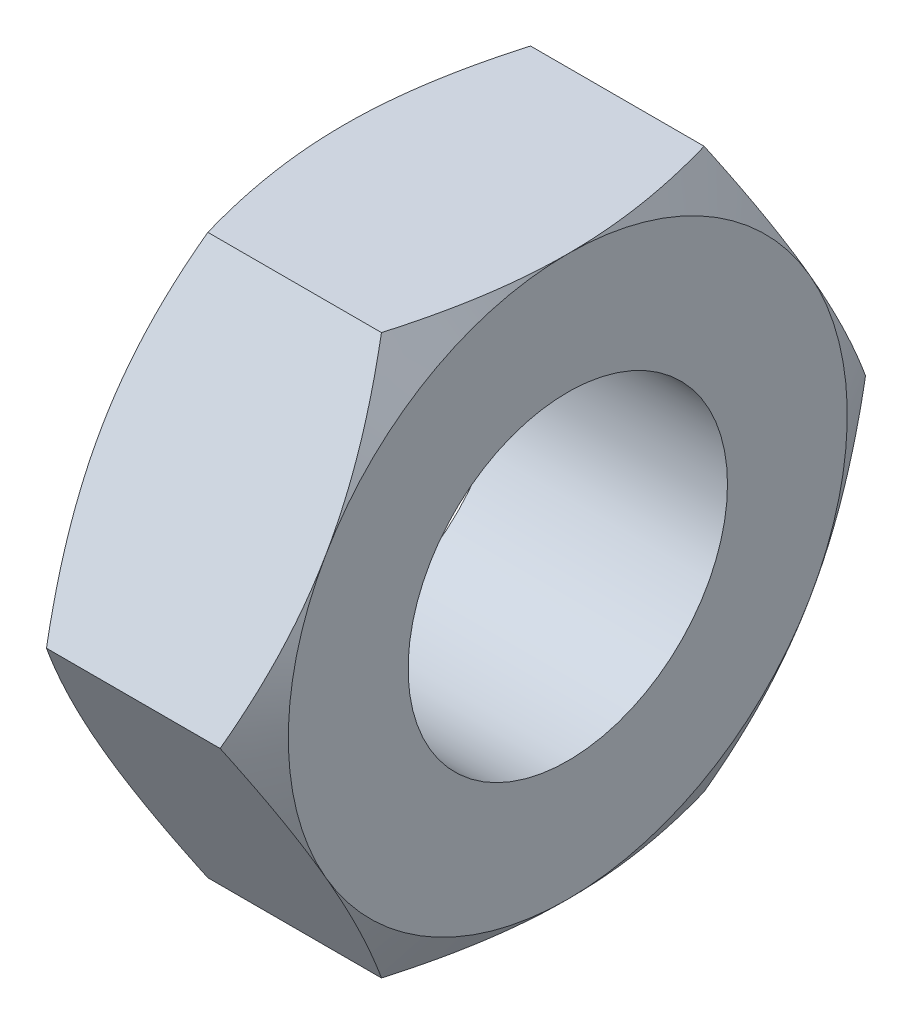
ISO-10303-21;
HEADER;
FILE_DESCRIPTION(('STEP AP214'),'2;1');
FILE_NAME('part.step','',(''),(''),'','','');
FILE_SCHEMA(('AUTOMOTIVE_DESIGN { 1 0 10303 214 1 1 1 1 }'));
ENDSEC;
DATA;
#1=APPLICATION_CONTEXT('core data for automotive mechanical design processes');
#2=APPLICATION_PROTOCOL_DEFINITION('international standard','automotive_design',2000,#1);
#3=PRODUCT_CONTEXT('',#1,'mechanical');
#4=PRODUCT('Part','Part','',(#3));
#5=PRODUCT_RELATED_PRODUCT_CATEGORY('part','',(#4));
#6=PRODUCT_DEFINITION_FORMATION('','',#4);
#7=PRODUCT_DEFINITION_CONTEXT('part definition',#1,'design');
#8=PRODUCT_DEFINITION('design','',#6,#7);
#9=PRODUCT_DEFINITION_SHAPE('','',#8);
#10=(LENGTH_UNIT() NAMED_UNIT(*) SI_UNIT(.MILLI.,.METRE.));
#11=(NAMED_UNIT(*) PLANE_ANGLE_UNIT() SI_UNIT($,.RADIAN.));
#12=(NAMED_UNIT(*) SI_UNIT($,.STERADIAN.) SOLID_ANGLE_UNIT());
#13=UNCERTAINTY_MEASURE_WITH_UNIT(LENGTH_MEASURE(1.E-05),#10,'distance_accuracy_value','');
#14=(GEOMETRIC_REPRESENTATION_CONTEXT(3) GLOBAL_UNCERTAINTY_ASSIGNED_CONTEXT((#13)) GLOBAL_UNIT_ASSIGNED_CONTEXT((#10,
#11,#12)) REPRESENTATION_CONTEXT('',''));
#15=CARTESIAN_POINT('',(0.,0.,0.));
#16=DIRECTION('',(0.,0.,1.));
#17=DIRECTION('',(1.,0.,0.));
#18=AXIS2_PLACEMENT_3D('',#15,#16,#17);
#19=CARTESIAN_POINT('',(0.,0.,0.));
#20=DIRECTION('',(1.,0.,0.));
#21=DIRECTION('',(0.,0.,-1.));
#22=AXIS2_PLACEMENT_3D('',#19,#20,#21);
#23=PLANE('',#22);
#24=CARTESIAN_POINT('',(0.,-0.0499999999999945,0.));
#25=DIRECTION('',(1.,0.,0.));
#26=DIRECTION('',(0.,0.5,-0.866025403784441));
#27=AXIS2_PLACEMENT_3D('',#24,#25,#26);
#28=CIRCLE('',#27,3.49999999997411);
#29=CARTESIAN_POINT('',(0.,1.69999999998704,-3.03108891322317));
#30=VERTEX_POINT('',#29);
#31=CARTESIAN_POINT('',(0.,3.4499999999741,0.));
#32=VERTEX_POINT('',#31);
#33=EDGE_CURVE('E114',#30,#32,#28,.T.);
#34=ORIENTED_EDGE('',*,*,#33,.F.);
#35=CARTESIAN_POINT('',(0.,-0.0499999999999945,0.));
#36=DIRECTION('',(1.,0.,0.));
#37=DIRECTION('',(0.,0.5,-0.866025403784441));
#38=AXIS2_PLACEMENT_3D('',#35,#36,#37);
#39=CIRCLE('',#38,3.49999999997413);
#40=CARTESIAN_POINT('',(0.,-1.79999999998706,-3.03108891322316));
#41=VERTEX_POINT('',#40);
#42=EDGE_CURVE('E103',#41,#30,#39,.T.);
#43=ORIENTED_EDGE('',*,*,#42,.F.);
#44=CARTESIAN_POINT('',(0.,-3.54999999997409,0.));
#45=VERTEX_POINT('',#44);
#46=EDGE_CURVE('E111',#45,#41,#39,.T.);
#47=ORIENTED_EDGE('',*,*,#46,.F.);
#48=CARTESIAN_POINT('',(0.,-1.79999999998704,3.03108891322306));
#49=VERTEX_POINT('',#48);
#50=EDGE_CURVE('E397',#49,#45,#39,.T.);
#51=ORIENTED_EDGE('',*,*,#50,.F.);
#52=CARTESIAN_POINT('',(0.,1.69999999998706,3.03108891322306));
#53=VERTEX_POINT('',#52);
#54=EDGE_CURVE('E395',#53,#49,#39,.T.);
#55=ORIENTED_EDGE('',*,*,#54,.F.);
#56=EDGE_CURVE('E24',#32,#53,#39,.T.);
#57=ORIENTED_EDGE('',*,*,#56,.F.);
#58=EDGE_LOOP('',(#34,#43,#47,#51,#55,#57));
#59=FACE_BOUND('',#58,.T.);
#60=CARTESIAN_POINT('',(0.,-0.0499999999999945,0.));
#61=DIRECTION('',(1.,0.,0.));
#62=DIRECTION('',(0.,0.,-1.));
#63=AXIS2_PLACEMENT_3D('',#60,#61,#62);
#64=CIRCLE('',#63,2.);
#65=CARTESIAN_POINT('',(0.,-0.0499999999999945,-2.00000000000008));
#66=VERTEX_POINT('',#65);
#67=EDGE_CURVE('E11',#66,#66,#64,.F.);
#68=ORIENTED_EDGE('',*,*,#67,.F.);
#69=EDGE_LOOP('',(#68));
#70=FACE_BOUND('',#69,.T.);
#71=ADVANCED_FACE('F17',(#59,#70),#23,.F.);
#72=CARTESIAN_POINT('',(2.48551696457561,-0.0499999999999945,0.));
#73=DIRECTION('',(-1.,0.,0.));
#74=DIRECTION('',(0.,-1.,0.));
#75=AXIS2_PLACEMENT_3D('',#72,#73,#74);
#76=CONICAL_SURFACE('',#75,4.04470059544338,1.04719755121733);
#77=CARTESIAN_POINT('',(2.7999999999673,-3.54999999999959,0.));
#78=CARTESIAN_POINT('',(2.80001430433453,-3.54999999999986,-0.0857684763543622));
#79=CARTESIAN_POINT('',(2.79818014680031,-3.54999999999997,-0.171532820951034));
#80=CARTESIAN_POINT('',(2.79092122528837,-3.55000000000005,-0.342893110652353));
#81=CARTESIAN_POINT('',(2.78549717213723,-3.55000000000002,-0.428489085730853));
#82=CARTESIAN_POINT('',(2.771200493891,-3.55,-0.598959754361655));
#83=CARTESIAN_POINT('',(2.76234522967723,-3.55000000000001,-0.683835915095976));
#84=CARTESIAN_POINT('',(2.74137660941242,-3.55000000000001,-0.853183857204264));
#85=CARTESIAN_POINT('',(2.72926316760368,-3.55000000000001,-0.93765562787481));
#86=CARTESIAN_POINT('',(2.68840979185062,-3.55000000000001,-1.19011421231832));
#87=CARTESIAN_POINT('',(2.65513697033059,-3.55000000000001,-1.35736762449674));
#88=CARTESIAN_POINT('',(2.57840133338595,-3.55000000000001,-1.69043614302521));
#89=CARTESIAN_POINT('',(2.53488762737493,-3.55000000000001,-1.85623963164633));
#90=CARTESIAN_POINT('',(2.4873926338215,-3.55,-2.02072585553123));
#91=B_SPLINE_CURVE_WITH_KNOTS('',3,(#77,#78,#79,#80,#81,#82,#83,#84,#85,#86,#87,#88,#89,#90),
.UNSPECIFIED.,.F.,.F.,(4,2,2,2,2,2,4),(0.,0.257279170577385,0.514507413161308,0.770450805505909,
1.0264009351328,1.53763035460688,2.05145599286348),.UNSPECIFIED.);
#92=CARTESIAN_POINT('',(2.79999999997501,-3.54999999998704,0.));
#93=VERTEX_POINT('',#92);
#94=CARTESIAN_POINT('',(2.4873926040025,-3.5500000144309,-2.02072593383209));
#95=VERTEX_POINT('',#94);
#96=EDGE_CURVE('E350',#93,#95,#91,.T.);
#97=ORIENTED_EDGE('',*,*,#96,.T.);
#98=CARTESIAN_POINT('',(2.48739257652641,-3.5500000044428,-2.02072589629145));
#99=CARTESIAN_POINT('',(2.53488758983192,-3.40755076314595,-2.10296903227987));
#100=CARTESIAN_POINT('',(2.57840130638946,-3.2639607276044,-2.18587078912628));
#101=CARTESIAN_POINT('',(2.65513695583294,-2.9755149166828,-2.35240506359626));
#102=CARTESIAN_POINT('',(2.68840977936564,-2.83066920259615,-2.43603177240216));
#103=CARTESIAN_POINT('',(2.72926315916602,-2.61203364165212,-2.56226107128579));
#104=CARTESIAN_POINT('',(2.74137660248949,-2.53887893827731,-2.60449695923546));
#105=CARTESIAN_POINT('',(2.76234522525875,-2.39221930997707,-2.68917093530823));
#106=CARTESIAN_POINT('',(2.77120049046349,-2.31871439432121,-2.73160901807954));
#107=CARTESIAN_POINT('',(2.78549717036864,-2.17108245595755,-2.81684435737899));
#108=CARTESIAN_POINT('',(2.79092122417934,-2.09695416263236,-2.85964234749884));
#109=CARTESIAN_POINT('',(2.79818014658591,-1.94855178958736,-2.94532249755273));
#110=CARTESIAN_POINT('',(2.80001430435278,-1.87427768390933,-2.98820467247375));
#111=CARTESIAN_POINT('',(2.7999999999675,-1.80000000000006,-3.03108891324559));
#112=B_SPLINE_CURVE_WITH_KNOTS('',3,(#98,#99,#100,#101,#102,#103,#104,#105,#106,#107,#108,#109,
#110,#111),.UNSPECIFIED.,.F.,.F.,(4,2,2,2,2,2,4),(0.,0.513825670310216,1.02505512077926,
1.28100526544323,1.5369486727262,1.79417693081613,2.05145611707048),.UNSPECIFIED.);
#113=CARTESIAN_POINT('',(2.79999999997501,-1.79999999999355,-3.0310889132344));
#114=VERTEX_POINT('',#113);
#115=EDGE_CURVE('E345',#95,#114,#112,.T.);
#116=ORIENTED_EDGE('',*,*,#115,.T.);
#117=CARTESIAN_POINT('',(2.7999999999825,-0.0499999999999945,0.));
#118=DIRECTION('',(-1.,0.,0.));
#119=DIRECTION('',(0.,-1.,0.));
#120=AXIS2_PLACEMENT_3D('',#117,#118,#119);
#121=CIRCLE('',#120,3.49999999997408);
#122=EDGE_CURVE('E309',#93,#114,#121,.F.);
#123=ORIENTED_EDGE('',*,*,#122,.F.);
#124=EDGE_LOOP('',(#97,#116,#123));
#125=FACE_BOUND('',#124,.T.);
#126=ADVANCED_FACE('F242',(#125),#76,.T.);
#127=CARTESIAN_POINT('',(2.48551696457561,-0.0499999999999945,0.));
#128=DIRECTION('',(-1.,0.,0.));
#129=DIRECTION('',(0.,-1.,0.));
#130=AXIS2_PLACEMENT_3D('',#127,#128,#129);
#131=CONICAL_SURFACE('',#130,4.04470059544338,1.04719755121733);
#132=CARTESIAN_POINT('',(2.7999999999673,3.4499999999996,0.));
#133=CARTESIAN_POINT('',(2.80001430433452,3.44999999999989,0.0857684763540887));
#134=CARTESIAN_POINT('',(2.7981801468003,3.45000000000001,0.171532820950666));
#135=CARTESIAN_POINT('',(2.79092122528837,3.4500000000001,0.342893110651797));
#136=CARTESIAN_POINT('',(2.78549717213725,3.45000000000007,0.428489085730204));
#137=CARTESIAN_POINT('',(2.77120049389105,3.45000000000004,0.59895975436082));
#138=CARTESIAN_POINT('',(2.7623452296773,3.45000000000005,0.683835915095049));
#139=CARTESIAN_POINT('',(2.74137660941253,3.45000000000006,0.853183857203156));
#140=CARTESIAN_POINT('',(2.72926316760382,3.45000000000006,0.937655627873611));
#141=CARTESIAN_POINT('',(2.68840979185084,3.45000000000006,1.19011421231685));
#142=CARTESIAN_POINT('',(2.65513697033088,3.45000000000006,1.3573676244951));
#143=CARTESIAN_POINT('',(2.57840133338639,3.45000000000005,1.69043614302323));
#144=CARTESIAN_POINT('',(2.53488762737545,3.45000000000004,1.85623963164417));
#145=CARTESIAN_POINT('',(2.4873926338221,3.45,2.0207258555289));
#146=B_SPLINE_CURVE_WITH_KNOTS('',3,(#132,#133,#134,#135,#136,#137,#138,#139,#140,#141,#142,
#143,#144,#145),.UNSPECIFIED.,.F.,.F.,(4,2,2,2,2,2,4),(0.,0.257279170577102,0.514507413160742,
0.770450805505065,1.02640093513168,1.5376303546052,2.05145599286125),.UNSPECIFIED.);
#147=CARTESIAN_POINT('',(2.79999999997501,3.44999999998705,-1.08962318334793E-13));
#148=VERTEX_POINT('',#147);
#149=CARTESIAN_POINT('',(2.48739260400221,3.45000001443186,2.02072593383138));
#150=VERTEX_POINT('',#149);
#151=EDGE_CURVE('E252',#148,#150,#146,.T.);
#152=ORIENTED_EDGE('',*,*,#151,.T.);
#153=CARTESIAN_POINT('',(2.4873925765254,3.45000000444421,2.02072589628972));
#154=CARTESIAN_POINT('',(2.53488758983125,3.30755076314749,2.10296903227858));
#155=CARTESIAN_POINT('',(2.57840130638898,3.16396072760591,2.18587078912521));
#156=CARTESIAN_POINT('',(2.65513695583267,2.87551491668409,2.35240506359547));
#157=CARTESIAN_POINT('',(2.68840977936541,2.73066920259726,2.43603177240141));
#158=CARTESIAN_POINT('',(2.72926315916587,2.512033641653,2.56226107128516));
#159=CARTESIAN_POINT('',(2.74137660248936,2.43887893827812,2.60449695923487));
#160=CARTESIAN_POINT('',(2.76234522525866,2.29221930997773,2.68917093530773));
#161=CARTESIAN_POINT('',(2.77120049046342,2.2187143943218,2.73160901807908));
#162=CARTESIAN_POINT('',(2.7854971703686,2.07108245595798,2.81684435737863));
#163=CARTESIAN_POINT('',(2.79092122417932,1.99695416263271,2.85964234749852));
#164=CARTESIAN_POINT('',(2.79818014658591,1.84855178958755,2.94532249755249));
#165=CARTESIAN_POINT('',(2.80001430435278,1.77427768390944,2.98820467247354));
#166=CARTESIAN_POINT('',(2.7999999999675,1.70000000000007,3.0310889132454));
#167=B_SPLINE_CURVE_WITH_KNOTS('',3,(#153,#154,#155,#156,#157,#158,#159,#160,#161,#162,#163,
#164,#165,#166),.UNSPECIFIED.,.F.,.F.,(4,2,2,2,2,2,4),(0.,0.513825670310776,1.02505512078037,
1.28100526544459,1.53694867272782,1.79417693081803,2.05145611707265),.UNSPECIFIED.);
#168=CARTESIAN_POINT('',(2.79999999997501,1.69999999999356,3.03108891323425));
#169=VERTEX_POINT('',#168);
#170=EDGE_CURVE('E246',#150,#169,#167,.T.);
#171=ORIENTED_EDGE('',*,*,#170,.T.);
#172=CARTESIAN_POINT('',(2.7999999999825,-0.0499999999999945,0.));
#173=DIRECTION('',(-1.,0.,0.));
#174=DIRECTION('',(0.,-1.,0.));
#175=AXIS2_PLACEMENT_3D('',#172,#173,#174);
#176=CIRCLE('',#175,3.49999999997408);
#177=EDGE_CURVE('E318',#148,#169,#176,.F.);
#178=ORIENTED_EDGE('',*,*,#177,.F.);
#179=EDGE_LOOP('',(#152,#171,#178));
#180=FACE_BOUND('',#179,.T.);
#181=ADVANCED_FACE('F237',(#180),#131,.T.);
#182=CARTESIAN_POINT('',(2.48551696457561,-0.0499999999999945,0.));
#183=DIRECTION('',(-1.,0.,0.));
#184=DIRECTION('',(0.,-1.,0.));
#185=AXIS2_PLACEMENT_3D('',#182,#183,#184);
#186=CONICAL_SURFACE('',#185,4.04470059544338,1.04719755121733);
#187=CARTESIAN_POINT('',(2.7999999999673,-1.79999999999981,-3.0310889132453));
#188=CARTESIAN_POINT('',(2.80001430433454,-1.7257223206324,-3.07397315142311));
#189=CARTESIAN_POINT('',(2.79818014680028,-1.65144821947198,-3.11685532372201));
#190=CARTESIAN_POINT('',(2.79092122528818,-1.50304585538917,-3.20253546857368));
#191=CARTESIAN_POINT('',(2.78549717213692,-1.42891756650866,-3.24533345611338));
#192=CARTESIAN_POINT('',(2.77120049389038,-1.28128563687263,-3.3305687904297));
#193=CARTESIAN_POINT('',(2.76234522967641,-1.20778072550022,-3.37300687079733));
#194=CARTESIAN_POINT('',(2.74137660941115,-1.06112110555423,-3.4576808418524));
#195=CARTESIAN_POINT('',(2.72926316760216,-0.987966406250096,-3.49991672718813));
#196=CARTESIAN_POINT('',(2.68840979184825,-0.769330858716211,-3.62614601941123));
#197=CARTESIAN_POINT('',(2.65513697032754,-0.62448515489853,-3.70977272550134));
#198=CARTESIAN_POINT('',(2.57840133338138,-0.336039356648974,-3.87630698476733));
#199=CARTESIAN_POINT('',(2.53488762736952,-0.192449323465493,-3.95920872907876));
#200=CARTESIAN_POINT('',(2.48739263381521,-0.0500000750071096,-4.04145184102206));
#201=B_SPLINE_CURVE_WITH_KNOTS('',3,(#187,#188,#189,#190,#191,#192,#193,#194,#195,#196,#197,
#198,#199,#200),.UNSPECIFIED.,.F.,.F.,(4,2,2,2,2,2,4),(0.,0.257279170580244,0.514507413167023,
0.770450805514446,1.02640093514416,1.53763035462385,2.05145599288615),.UNSPECIFIED.);
#202=CARTESIAN_POINT('',(2.4873926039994,-0.0500000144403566,-4.04145189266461));
#203=VERTEX_POINT('',#202);
#204=EDGE_CURVE('E331',#114,#203,#201,.T.);
#205=ORIENTED_EDGE('',*,*,#204,.T.);
#206=CARTESIAN_POINT('',(2.4873925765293,-0.0500000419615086,-4.04145186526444));
#207=CARTESIAN_POINT('',(2.53488758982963,0.0924492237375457,-3.9592087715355));
#208=CARTESIAN_POINT('',(2.5784013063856,0.236039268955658,-3.87630703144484));
#209=CARTESIAN_POINT('',(2.65513695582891,0.524485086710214,-3.70977276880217));
#210=CARTESIAN_POINT('',(2.68840977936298,0.669330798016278,-3.62614605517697));
#211=CARTESIAN_POINT('',(2.72926315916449,0.88796635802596,-3.49991675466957));
#212=CARTESIAN_POINT('',(2.74137660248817,0.961121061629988,-3.45768086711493));
#213=CARTESIAN_POINT('',(2.76234522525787,1.10778069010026,-3.37300689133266));
#214=CARTESIAN_POINT('',(2.77120049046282,1.18128560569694,-3.33056880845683));
#215=CARTESIAN_POINT('',(2.78549717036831,1.32891754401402,-3.2453334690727));
#216=CARTESIAN_POINT('',(2.79092122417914,1.40304583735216,-3.20253547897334));
#217=CARTESIAN_POINT('',(2.79818014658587,1.55144821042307,-3.11685532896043));
#218=CARTESIAN_POINT('',(2.80001430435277,1.62572231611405,-3.07397315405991));
#219=CARTESIAN_POINT('',(2.7999999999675,1.69999999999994,-3.03108891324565));
#220=B_SPLINE_CURVE_WITH_KNOTS('',3,(#206,#207,#208,#209,#210,#211,#212,#213,#214,#215,#216,
#217,#218,#219),.UNSPECIFIED.,.F.,.F.,(4,2,2,2,2,2,4),(0.,0.513825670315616,1.02505512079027,
1.28100526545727,1.53694867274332,1.7941769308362,2.05145611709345),.UNSPECIFIED.);
#221=CARTESIAN_POINT('',(2.79999999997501,1.69999999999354,-3.03108891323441));
#222=VERTEX_POINT('',#221);
#223=EDGE_CURVE('E324',#203,#222,#220,.T.);
#224=ORIENTED_EDGE('',*,*,#223,.T.);
#225=CARTESIAN_POINT('',(2.7999999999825,-0.0499999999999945,0.));
#226=DIRECTION('',(-1.,0.,0.));
#227=DIRECTION('',(0.,-1.,0.));
#228=AXIS2_PLACEMENT_3D('',#225,#226,#227);
#229=CIRCLE('',#228,3.49999999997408);
#230=EDGE_CURVE('E112',#114,#222,#229,.F.);
#231=ORIENTED_EDGE('',*,*,#230,.F.);
#232=EDGE_LOOP('',(#205,#224,#231));
#233=FACE_BOUND('',#232,.T.);
#234=ADVANCED_FACE('F241',(#233),#186,.T.);
#235=CARTESIAN_POINT('',(2.48551696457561,-0.0499999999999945,0.));
#236=DIRECTION('',(-1.,0.,0.));
#237=DIRECTION('',(0.,-1.,0.));
#238=AXIS2_PLACEMENT_3D('',#235,#236,#237);
#239=CONICAL_SURFACE('',#238,4.04470059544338,1.04719755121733);
#240=CARTESIAN_POINT('',(2.7999999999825,-0.0499999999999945,0.));
#241=DIRECTION('',(-1.,0.,0.));
#242=DIRECTION('',(0.,-1.,0.));
#243=AXIS2_PLACEMENT_3D('',#240,#241,#242);
#244=CIRCLE('',#243,3.49999999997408);
#245=EDGE_CURVE('E321',#222,#148,#244,.F.);
#246=ORIENTED_EDGE('',*,*,#245,.F.);
#247=CARTESIAN_POINT('',(2.7999999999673,1.69999999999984,-3.03108891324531));
#248=CARTESIAN_POINT('',(2.80001430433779,1.77427768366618,-2.98820467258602));
#249=CARTESIAN_POINT('',(2.79818014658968,1.8485517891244,-2.945322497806));
#250=CARTESIAN_POINT('',(2.79092122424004,1.99695416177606,-2.85964234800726));
#251=CARTESIAN_POINT('',(2.78549717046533,2.07108245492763,-2.8168443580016));
#252=CARTESIAN_POINT('',(2.77120049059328,2.21871439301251,-2.73160901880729));
#253=CARTESIAN_POINT('',(2.76234522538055,2.29221930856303,-2.68917093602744));
#254=CARTESIAN_POINT('',(2.74137660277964,2.43887893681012,-2.60449696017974));
#255=CARTESIAN_POINT('',(2.72926315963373,2.51203364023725,-2.5622610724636));
#256=CARTESIAN_POINT('',(2.68840977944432,2.73066920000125,-2.43603177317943));
#257=CARTESIAN_POINT('',(2.6551369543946,2.87551491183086,-2.35240506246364));
#258=CARTESIAN_POINT('',(2.57840130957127,3.16396072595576,-2.18587079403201));
#259=CARTESIAN_POINT('',(2.53488759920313,3.30755076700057,-2.10296904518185));
#260=CARTESIAN_POINT('',(2.48739260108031,3.45000002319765,-2.0207259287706));
#261=B_SPLINE_CURVE_WITH_KNOTS('',3,(#247,#248,#249,#250,#251,#252,#253,#254,#255,#256,#257,
#258,#259,#260),.UNSPECIFIED.,.F.,.F.,(4,2,2,2,2,2,4),(0.,0.257279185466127,0.514507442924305,
0.770450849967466,1.02640099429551,1.53763044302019,2.05145611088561),.UNSPECIFIED.);
#262=CARTESIAN_POINT('',(2.4873926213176,3.45,-2.02072589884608));
#263=VERTEX_POINT('',#262);
#264=EDGE_CURVE('E259',#222,#263,#261,.T.);
#265=ORIENTED_EDGE('',*,*,#264,.T.);
#266=CARTESIAN_POINT('',(2.4873926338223,3.45,-2.02072585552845));
#267=CARTESIAN_POINT('',(2.53488762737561,3.45000000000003,-1.85623963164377));
#268=CARTESIAN_POINT('',(2.57840133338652,3.45000000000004,-1.69043614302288));
#269=CARTESIAN_POINT('',(2.65513697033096,3.45000000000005,-1.35736762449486));
#270=CARTESIAN_POINT('',(2.68840979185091,3.45000000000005,-1.19011421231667));
#271=CARTESIAN_POINT('',(2.72926316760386,3.45000000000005,-0.93765562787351));
#272=CARTESIAN_POINT('',(2.74137660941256,3.45000000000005,-0.853183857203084));
#273=CARTESIAN_POINT('',(2.76234522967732,3.45000000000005,-0.683835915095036));
#274=CARTESIAN_POINT('',(2.77120049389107,3.45000000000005,-0.598959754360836));
#275=CARTESIAN_POINT('',(2.78549717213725,3.45000000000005,-0.428489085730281));
#276=CARTESIAN_POINT('',(2.79092122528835,3.45000000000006,-0.342893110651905));
#277=CARTESIAN_POINT('',(2.79818014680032,3.45000000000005,-0.17153282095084));
#278=CARTESIAN_POINT('',(2.80001430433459,3.45000000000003,-0.0857684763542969));
#279=CARTESIAN_POINT('',(2.7999999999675,3.45,-1.47017814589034E-13));
#280=B_SPLINE_CURVE_WITH_KNOTS('',3,(#266,#267,#268,#269,#270,#271,#272,#273,#274,#275,#276,
#277,#278,#279),.UNSPECIFIED.,.F.,.F.,(4,2,2,2,2,2,4),(0.,0.513825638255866,1.02505505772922,
1.28100518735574,1.53694857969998,1.79417682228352,2.05145599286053),.UNSPECIFIED.);
#281=EDGE_CURVE('E273',#263,#148,#280,.T.);
#282=ORIENTED_EDGE('',*,*,#281,.T.);
#283=EDGE_LOOP('',(#246,#265,#282));
#284=FACE_BOUND('',#283,.T.);
#285=ADVANCED_FACE('F233',(#284),#239,.T.);
#286=CARTESIAN_POINT('',(2.48551696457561,-0.0499999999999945,0.));
#287=DIRECTION('',(-1.,0.,0.));
#288=DIRECTION('',(0.,-1.,0.));
#289=AXIS2_PLACEMENT_3D('',#286,#287,#288);
#290=CONICAL_SURFACE('',#289,4.04470059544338,1.04719755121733);
#291=CARTESIAN_POINT('',(2.7999999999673,1.69999999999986,3.0310889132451));
#292=CARTESIAN_POINT('',(2.80001430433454,1.6257223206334,3.0739731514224));
#293=CARTESIAN_POINT('',(2.79818014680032,1.55144821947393,3.11685532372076));
#294=CARTESIAN_POINT('',(2.79092122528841,1.40304585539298,3.20253546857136));
#295=CARTESIAN_POINT('',(2.78549717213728,1.32891756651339,3.24533345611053));
#296=CARTESIAN_POINT('',(2.7712004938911,1.1812856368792,3.33056879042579));
#297=CARTESIAN_POINT('',(2.76234522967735,1.10778072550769,3.37300687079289));
#298=CARTESIAN_POINT('',(2.7413766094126,0.961121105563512,3.45768084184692));
#299=CARTESIAN_POINT('',(2.7292631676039,0.88796640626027,3.49991672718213));
#300=CARTESIAN_POINT('',(2.68840979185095,0.669330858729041,3.62614601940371));
#301=CARTESIAN_POINT('',(2.65513697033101,0.5244851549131,3.7097727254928));
#302=CARTESIAN_POINT('',(2.57840133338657,0.236039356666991,3.87630698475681));
#303=CARTESIAN_POINT('',(2.53488762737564,0.0924493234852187,3.95920872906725));
#304=CARTESIAN_POINT('',(2.4873926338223,-0.0499999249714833,4.04145184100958));
#305=B_SPLINE_CURVE_WITH_KNOTS('',3,(#291,#292,#293,#294,#295,#296,#297,#298,#299,#300,#301,
#302,#303,#304),.UNSPECIFIED.,.F.,.F.,(4,2,2,2,2,2,4),(0.,0.25727917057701,0.514507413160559,
0.770450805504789,1.02640093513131,1.53763035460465,2.05145599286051),.UNSPECIFIED.);
#306=CARTESIAN_POINT('',(2.48739260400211,-0.0499999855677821,4.04145189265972));
#307=VERTEX_POINT('',#306);
#308=EDGE_CURVE('E218',#169,#307,#305,.T.);
#309=ORIENTED_EDGE('',*,*,#308,.T.);
#310=CARTESIAN_POINT('',(2.487392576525,-0.0499999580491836,4.04145186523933));
#311=CARTESIAN_POINT('',(2.53488758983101,-0.192449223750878,3.95920877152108));
#312=CARTESIAN_POINT('',(2.57840130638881,-0.336039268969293,3.87630703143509));
#313=CARTESIAN_POINT('',(2.6551369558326,-0.624485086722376,3.70977276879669));
#314=CARTESIAN_POINT('',(2.68840977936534,-0.769330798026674,3.62614605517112));
#315=CARTESIAN_POINT('',(2.72926315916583,-0.987966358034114,3.49991675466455));
#316=CARTESIAN_POINT('',(2.74137660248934,-1.06112106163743,3.45768086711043));
#317=CARTESIAN_POINT('',(2.76234522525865,-1.20778069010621,3.3730068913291));
#318=CARTESIAN_POINT('',(2.77120049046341,-1.2812856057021,3.33056880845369));
#319=CARTESIAN_POINT('',(2.7854971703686,-1.42891754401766,3.24533346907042));
#320=CARTESIAN_POINT('',(2.79092122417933,-1.50304583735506,3.20253547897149));
#321=CARTESIAN_POINT('',(2.79818014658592,-1.65144821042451,3.11685532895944));
#322=CARTESIAN_POINT('',(2.80001430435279,-1.72572231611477,3.07397315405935));
#323=CARTESIAN_POINT('',(2.7999999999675,-1.79999999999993,3.0310889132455));
#324=B_SPLINE_CURVE_WITH_KNOTS('',3,(#310,#311,#312,#313,#314,#315,#316,#317,#318,#319,#320,
#321,#322,#323),.UNSPECIFIED.,.F.,.F.,(4,2,2,2,2,2,4),(0.,0.513825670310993,1.02505512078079,
1.28100526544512,1.53694867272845,1.79417693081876,2.05145611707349),.UNSPECIFIED.);
#325=CARTESIAN_POINT('',(2.79999999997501,-1.79999999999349,3.03108891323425));
#326=VERTEX_POINT('',#325);
#327=EDGE_CURVE('E209',#307,#326,#324,.T.);
#328=ORIENTED_EDGE('',*,*,#327,.T.);
#329=CARTESIAN_POINT('',(2.7999999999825,-0.0499999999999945,0.));
#330=DIRECTION('',(-1.,0.,0.));
#331=DIRECTION('',(0.,-1.,0.));
#332=AXIS2_PLACEMENT_3D('',#329,#330,#331);
#333=CIRCLE('',#332,3.49999999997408);
#334=EDGE_CURVE('E315',#169,#326,#333,.F.);
#335=ORIENTED_EDGE('',*,*,#334,.F.);
#336=EDGE_LOOP('',(#309,#328,#335));
#337=FACE_BOUND('',#336,.T.);
#338=ADVANCED_FACE('F228',(#337),#290,.T.);
#339=CARTESIAN_POINT('',(2.48551696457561,-0.0499999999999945,0.));
#340=DIRECTION('',(-1.,0.,0.));
#341=DIRECTION('',(0.,-1.,0.));
#342=AXIS2_PLACEMENT_3D('',#339,#340,#341);
#343=CONICAL_SURFACE('',#342,4.04470059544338,1.04719755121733);
#344=CARTESIAN_POINT('',(2.7999999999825,-0.0499999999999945,0.));
#345=DIRECTION('',(-1.,0.,0.));
#346=DIRECTION('',(0.,-1.,0.));
#347=AXIS2_PLACEMENT_3D('',#344,#345,#346);
#348=CIRCLE('',#347,3.49999999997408);
#349=EDGE_CURVE('E312',#326,#93,#348,.F.);
#350=ORIENTED_EDGE('',*,*,#349,.F.);
#351=CARTESIAN_POINT('',(2.7999999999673,-1.79999999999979,3.03108891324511));
#352=CARTESIAN_POINT('',(2.8000143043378,-1.87427768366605,2.9882046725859));
#353=CARTESIAN_POINT('',(2.79818014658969,-1.94855178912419,2.94532249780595));
#354=CARTESIAN_POINT('',(2.79092122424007,-2.09695416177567,2.85964234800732));
#355=CARTESIAN_POINT('',(2.78549717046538,-2.17108245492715,2.81684435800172));
#356=CARTESIAN_POINT('',(2.77120049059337,-2.31871439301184,2.73160901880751));
#357=CARTESIAN_POINT('',(2.76234522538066,-2.39221930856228,2.68917093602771));
#358=CARTESIAN_POINT('',(2.74137660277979,-2.5388789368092,2.60449696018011));
#359=CARTESIAN_POINT('',(2.72926315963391,-2.61203364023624,2.56226107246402));
#360=CARTESIAN_POINT('',(2.6884097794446,-2.83066919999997,2.43603177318));
#361=CARTESIAN_POINT('',(2.65513695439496,-2.97551491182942,2.3524050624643));
#362=CARTESIAN_POINT('',(2.57840130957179,-3.26396072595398,2.18587079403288));
#363=CARTESIAN_POINT('',(2.53488759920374,-3.40755076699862,2.10296904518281));
#364=CARTESIAN_POINT('',(2.48739260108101,-3.55000002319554,2.02072592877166));
#365=B_SPLINE_CURVE_WITH_KNOTS('',3,(#351,#352,#353,#354,#355,#356,#357,#358,#359,#360,#361,
#362,#363,#364),.UNSPECIFIED.,.F.,.F.,(4,2,2,2,2,2,4),(0.,0.257279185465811,0.514507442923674,
0.770450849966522,1.02640099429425,1.53763044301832,2.0514561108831),.UNSPECIFIED.);
#366=CARTESIAN_POINT('',(2.48739262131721,-3.55,2.02072589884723));
#367=VERTEX_POINT('',#366);
#368=EDGE_CURVE('E200',#326,#367,#365,.T.);
#369=ORIENTED_EDGE('',*,*,#368,.T.);
#370=CARTESIAN_POINT('',(2.4873926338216,-3.55,2.02072585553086));
#371=CARTESIAN_POINT('',(2.534887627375,-3.55,1.85623963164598));
#372=CARTESIAN_POINT('',(2.57840133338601,-3.55,1.69043614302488));
#373=CARTESIAN_POINT('',(2.65513697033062,-3.55,1.35736762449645));
#374=CARTESIAN_POINT('',(2.68840979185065,-3.55,1.19011421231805));
#375=CARTESIAN_POINT('',(2.7292631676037,-3.55,0.937655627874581));
#376=CARTESIAN_POINT('',(2.74137660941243,-3.55,0.853183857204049));
#377=CARTESIAN_POINT('',(2.76234522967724,-3.55,0.683835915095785));
#378=CARTESIAN_POINT('',(2.77120049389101,-3.55,0.598959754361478));
#379=CARTESIAN_POINT('',(2.78549717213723,-3.55000000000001,0.428489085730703));
#380=CARTESIAN_POINT('',(2.79092122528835,-3.55000000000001,0.342893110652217));
#381=CARTESIAN_POINT('',(2.79818014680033,-3.55000000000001,0.17153282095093));
#382=CARTESIAN_POINT('',(2.80001430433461,-3.55,0.0857684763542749));
#383=CARTESIAN_POINT('',(2.7999999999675,-3.55,0.));
#384=B_SPLINE_CURVE_WITH_KNOTS('',3,(#370,#371,#372,#373,#374,#375,#376,#377,#378,#379,#380,
#381,#382,#383),.UNSPECIFIED.,.F.,.F.,(4,2,2,2,2,2,4),(0.,0.513825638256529,1.02505505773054,
1.28100518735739,1.53694857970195,1.79417682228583,2.05145599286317),.UNSPECIFIED.);
#385=EDGE_CURVE('E217',#367,#93,#384,.T.);
#386=ORIENTED_EDGE('',*,*,#385,.T.);
#387=EDGE_LOOP('',(#350,#369,#386));
#388=FACE_BOUND('',#387,.T.);
#389=ADVANCED_FACE('F232',(#388),#343,.T.);
#390=CARTESIAN_POINT('',(-0.4,3.45000000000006,2.02072594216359));
#391=DIRECTION('',(0.,0.5,0.866025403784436));
#392=DIRECTION('',(0.,-0.866025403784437,0.5));
#393=AXIS2_PLACEMENT_3D('',#390,#391,#392);
#394=PLANE('',#393);
#395=DIRECTION('',(1.,0.,0.));
#396=VECTOR('',#395,1.);
#397=CARTESIAN_POINT('',(-0.4,3.45000000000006,2.02072594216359));
#398=LINE('',#397,#396);
#399=CARTESIAN_POINT('',(0.312607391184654,3.45000000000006,2.02072594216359));
#400=VERTEX_POINT('',#399);
#401=EDGE_CURVE('E299',#150,#400,#398,.F.);
#402=ORIENTED_EDGE('',*,*,#401,.T.);
#403=CARTESIAN_POINT('',(0.312708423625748,3.45030307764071,2.02055096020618));
#404=CARTESIAN_POINT('',(0.261417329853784,3.29649415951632,2.10935258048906));
#405=CARTESIAN_POINT('',(0.214769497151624,3.14135757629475,2.1989207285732));
#406=CARTESIAN_POINT('',(0.133344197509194,2.82839790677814,2.3796080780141));
#407=CARTESIAN_POINT('',(0.09859553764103,2.67056925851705,2.47073049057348));
#408=CARTESIAN_POINT('',(0.0445027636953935,2.35686800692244,2.65184599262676));
#409=CARTESIAN_POINT('',(0.0247986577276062,2.20104367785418,2.74181121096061));
#410=CARTESIAN_POINT('',(0.0012735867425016,1.88866159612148,2.92216508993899));
#411=CARTESIAN_POINT('',(-0.00256685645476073,1.7321049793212,3.01255309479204));
#412=CARTESIAN_POINT('',(0.00541113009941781,1.4395557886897,3.18145644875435));
#413=CARTESIAN_POINT('',(0.0152706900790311,1.30351948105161,3.25999704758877));
#414=CARTESIAN_POINT('',(0.0465232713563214,1.03233316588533,3.41656653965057));
#415=CARTESIAN_POINT('',(0.0679269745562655,0.8971840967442,3.49459489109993));
#416=CARTESIAN_POINT('',(0.121435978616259,0.625438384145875,3.6514873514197));
#417=CARTESIAN_POINT('',(0.153768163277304,0.488876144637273,3.73033159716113));
#418=CARTESIAN_POINT('',(0.227150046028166,0.217788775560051,3.88684396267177));
#419=CARTESIAN_POINT('',(0.268182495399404,0.0832601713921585,3.96451408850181));
#420=CARTESIAN_POINT('',(0.312708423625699,-0.0503030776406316,4.04162686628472));
#421=B_SPLINE_CURVE_WITH_KNOTS('',3,(#403,#404,#405,#406,#407,#408,#409,#410,#411,#412,#413,
#414,#415,#416,#417,#418,#419,#420),.UNSPECIFIED.,.F.,.F.,(4,2,2,2,2,2,2,2,4),(0.,
0.554801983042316,1.11093776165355,1.65330856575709,2.19501322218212,2.66673515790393,
3.13889433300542,3.62152851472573,4.10321464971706),.UNSPECIFIED.);
#422=EDGE_CURVE('E381',#400,#53,#421,.T.);
#423=ORIENTED_EDGE('',*,*,#422,.T.);
#424=CARTESIAN_POINT('',(0.312607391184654,-0.0499999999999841,4.04145188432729));
#425=VERTEX_POINT('',#424);
#426=EDGE_CURVE('E182',#53,#425,#421,.T.);
#427=ORIENTED_EDGE('',*,*,#426,.T.);
#428=DIRECTION('',(1.,0.,0.));
#429=VECTOR('',#428,1.);
#430=CARTESIAN_POINT('',(-0.4,-0.0499999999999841,4.04145188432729));
#431=LINE('',#430,#429);
#432=EDGE_CURVE('E294',#307,#425,#431,.F.);
#433=ORIENTED_EDGE('',*,*,#432,.F.);
#434=ORIENTED_EDGE('',*,*,#308,.F.);
#435=ORIENTED_EDGE('',*,*,#170,.F.);
#436=EDGE_LOOP('',(#402,#423,#427,#433,#434,#435));
#437=FACE_BOUND('',#436,.T.);
#438=ADVANCED_FACE('F193',(#437),#394,.T.);
#439=CARTESIAN_POINT('',(-0.4,-0.0499999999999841,4.04145188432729));
#440=DIRECTION('',(0.,-0.5,0.86602540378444));
#441=DIRECTION('',(0.,-0.866025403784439,-0.5));
#442=AXIS2_PLACEMENT_3D('',#439,#440,#441);
#443=PLANE('',#442);
#444=ORIENTED_EDGE('',*,*,#432,.T.);
#445=CARTESIAN_POINT('',(0.312694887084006,-0.0497375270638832,4.04160342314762));
#446=CARTESIAN_POINT('',(0.261404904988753,-0.203545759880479,3.95280219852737));
#447=CARTESIAN_POINT('',(0.214758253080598,-0.358681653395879,3.86323444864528));
#448=CARTESIAN_POINT('',(0.133335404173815,-0.671639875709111,3.68254793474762));
#449=CARTESIAN_POINT('',(0.0985880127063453,-0.829467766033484,3.59142595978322));
#450=CARTESIAN_POINT('',(0.0444977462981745,-1.1431675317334,3.41031131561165));
#451=CARTESIAN_POINT('',(0.0247948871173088,-1.2989911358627,3.32034651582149));
#452=CARTESIAN_POINT('',(0.00127222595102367,-1.61137168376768,3.13999352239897));
#453=CARTESIAN_POINT('',(-0.00256705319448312,-1.76792749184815,3.04960598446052));
#454=CARTESIAN_POINT('',(0.00541277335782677,-2.06046981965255,2.88070659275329));
#455=CARTESIAN_POINT('',(0.0152725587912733,-2.19650009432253,2.80216947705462));
#456=CARTESIAN_POINT('',(0.0465245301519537,-2.46767439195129,2.64560692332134));
#457=CARTESIAN_POINT('',(0.0679273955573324,-2.60281747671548,2.56758202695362));
#458=CARTESIAN_POINT('',(0.121433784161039,-2.87455104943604,2.41069657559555));
#459=CARTESIAN_POINT('',(0.153764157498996,-3.01110713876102,2.33185588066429));
#460=CARTESIAN_POINT('',(0.227141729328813,-3.28218241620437,2.17535049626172));
#461=CARTESIAN_POINT('',(0.268171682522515,-3.41670507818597,2.09768380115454));
#462=CARTESIAN_POINT('',(0.312694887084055,-3.55026247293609,2.02057440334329));
#463=B_SPLINE_CURVE_WITH_KNOTS('',3,(#445,#446,#447,#448,#449,#450,#451,#452,#453,#454,#455,
#456,#457,#458,#459,#460,#461,#462),.UNSPECIFIED.,.F.,.F.,(4,2,2,2,2,2,2,2,4),(0.,
0.554798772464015,1.11093125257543,1.65329915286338,2.1950009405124,2.66670212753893,
3.13884047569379,3.62145272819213,4.10311708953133),.UNSPECIFIED.);
#464=EDGE_CURVE('E180',#425,#49,#463,.T.);
#465=ORIENTED_EDGE('',*,*,#464,.T.);
#466=CARTESIAN_POINT('',(0.312607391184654,-3.55,2.02072594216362));
#467=VERTEX_POINT('',#466);
#468=EDGE_CURVE('E173',#49,#467,#463,.T.);
#469=ORIENTED_EDGE('',*,*,#468,.T.);
#470=DIRECTION('',(1.,0.,0.));
#471=VECTOR('',#470,1.);
#472=CARTESIAN_POINT('',(-0.4,-3.55,2.02072594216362));
#473=LINE('',#472,#471);
#474=EDGE_CURVE('E289',#367,#467,#473,.F.);
#475=ORIENTED_EDGE('',*,*,#474,.F.);
#476=ORIENTED_EDGE('',*,*,#368,.F.);
#477=ORIENTED_EDGE('',*,*,#327,.F.);
#478=EDGE_LOOP('',(#444,#465,#469,#475,#476,#477));
#479=FACE_BOUND('',#478,.T.);
#480=ADVANCED_FACE('F189',(#479),#443,.T.);
#481=CARTESIAN_POINT('',(-0.4,-3.55,2.02072594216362));
#482=DIRECTION('',(0.,-1.,0.));
#483=DIRECTION('',(1.,0.,0.));
#484=AXIS2_PLACEMENT_3D('',#481,#482,#483);
#485=PLANE('',#484);
#486=ORIENTED_EDGE('',*,*,#474,.T.);
#487=CARTESIAN_POINT('',(0.312708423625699,-3.55,2.02107590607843));
#488=CARTESIAN_POINT('',(0.261417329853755,-3.55,1.84347266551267));
#489=CARTESIAN_POINT('',(0.214769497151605,-3.55,1.6643363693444));
#490=CARTESIAN_POINT('',(0.133344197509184,-3.55,1.30296167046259));
#491=CARTESIAN_POINT('',(0.0985955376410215,-3.55,1.12071684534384));
#492=CARTESIAN_POINT('',(0.0445027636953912,-3.55,0.758485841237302));
#493=CARTESIAN_POINT('',(0.0247986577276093,-3.55000000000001,0.578555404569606));
#494=CARTESIAN_POINT('',(0.00127358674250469,-3.55,0.217847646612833));
#495=CARTESIAN_POINT('',(-0.00256685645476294,-3.55,0.037071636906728));
#496=CARTESIAN_POINT('',(0.00541113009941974,-3.55,-0.300735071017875));
#497=CARTESIAN_POINT('',(0.0152706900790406,-3.55000000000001,-0.457816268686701));
#498=CARTESIAN_POINT('',(0.0465232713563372,-3.55000000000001,-0.770955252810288));
#499=CARTESIAN_POINT('',(0.06792697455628,-3.55000000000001,-0.927011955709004));
#500=CARTESIAN_POINT('',(0.121435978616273,-3.55000000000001,-1.24079687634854));
#501=CARTESIAN_POINT('',(0.153768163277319,-3.55000000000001,-1.39848536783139));
#502=CARTESIAN_POINT('',(0.227150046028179,-3.55000000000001,-1.71151009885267));
#503=CARTESIAN_POINT('',(0.268182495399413,-3.55000000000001,-1.86685035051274));
#504=CARTESIAN_POINT('',(0.312708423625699,-3.55,-2.02107590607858));
#505=B_SPLINE_CURVE_WITH_KNOTS('',3,(#487,#488,#489,#490,#491,#492,#493,#494,#495,#496,#497,
#498,#499,#500,#501,#502,#503,#504),.UNSPECIFIED.,.F.,.F.,(4,2,2,2,2,2,2,2,4),(0.,
0.554801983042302,1.11093776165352,1.65330856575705,2.19501322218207,2.66673515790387,
3.13889433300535,3.62152851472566,4.10321464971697),.UNSPECIFIED.);
#506=EDGE_CURVE('E181',#467,#45,#505,.T.);
#507=ORIENTED_EDGE('',*,*,#506,.T.);
#508=CARTESIAN_POINT('',(0.312607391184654,-3.55,-2.02072594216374));
#509=VERTEX_POINT('',#508);
#510=EDGE_CURVE('E166',#45,#509,#505,.T.);
#511=ORIENTED_EDGE('',*,*,#510,.T.);
#512=DIRECTION('',(1.,0.,0.));
#513=VECTOR('',#512,1.);
#514=CARTESIAN_POINT('',(-0.4,-3.55,-2.02072594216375));
#515=LINE('',#514,#513);
#516=EDGE_CURVE('E281',#95,#509,#515,.F.);
#517=ORIENTED_EDGE('',*,*,#516,.F.);
#518=ORIENTED_EDGE('',*,*,#96,.F.);
#519=ORIENTED_EDGE('',*,*,#385,.F.);
#520=EDGE_LOOP('',(#486,#507,#511,#517,#518,#519));
#521=FACE_BOUND('',#520,.T.);
#522=ADVANCED_FACE('F192',(#521),#485,.T.);
#523=CARTESIAN_POINT('',(-0.4,-3.55,-2.02072594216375));
#524=DIRECTION('',(0.,-0.5,-0.866025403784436));
#525=DIRECTION('',(0.,0.866025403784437,-0.5));
#526=AXIS2_PLACEMENT_3D('',#523,#524,#525);
#527=PLANE('',#526);
#528=ORIENTED_EDGE('',*,*,#516,.T.);
#529=CARTESIAN_POINT('',(0.312708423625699,-3.55030307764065,-2.02055096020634));
#530=CARTESIAN_POINT('',(0.261417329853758,-3.39649415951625,-2.10935258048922));
#531=CARTESIAN_POINT('',(0.214769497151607,-3.24135757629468,-2.19892072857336));
#532=CARTESIAN_POINT('',(0.133344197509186,-2.92839790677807,-2.37960807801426));
#533=CARTESIAN_POINT('',(0.0985955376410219,-2.77056925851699,-2.47073049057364));
#534=CARTESIAN_POINT('',(0.0445027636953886,-2.45686800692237,-2.65184599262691));
#535=CARTESIAN_POINT('',(0.024798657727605,-2.30104367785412,-2.74181121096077));
#536=CARTESIAN_POINT('',(0.00127358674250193,-1.98866159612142,-2.92216508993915));
#537=CARTESIAN_POINT('',(-0.00256685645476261,-1.83210497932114,-3.01255309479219));
#538=CARTESIAN_POINT('',(0.0054111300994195,-1.53955578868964,-3.1814564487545));
#539=CARTESIAN_POINT('',(0.0152706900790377,-1.40351948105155,-3.25999704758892));
#540=CARTESIAN_POINT('',(0.0465232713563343,-1.13233316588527,-3.41656653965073));
#541=CARTESIAN_POINT('',(0.0679269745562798,-0.997184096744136,-3.49459489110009));
#542=CARTESIAN_POINT('',(0.121435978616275,-0.725438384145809,-3.65148735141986));
#543=CARTESIAN_POINT('',(0.153768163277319,-0.588876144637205,-3.73033159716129));
#544=CARTESIAN_POINT('',(0.227150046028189,-0.317788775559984,-3.88684396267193));
#545=CARTESIAN_POINT('',(0.268182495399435,-0.183260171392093,-3.96451408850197));
#546=CARTESIAN_POINT('',(0.312708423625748,-0.0496969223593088,-4.04162686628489));
#547=B_SPLINE_CURVE_WITH_KNOTS('',3,(#529,#530,#531,#532,#533,#534,#535,#536,#537,#538,#539,
#540,#541,#542,#543,#544,#545,#546),.UNSPECIFIED.,.F.,.F.,(4,2,2,2,2,2,2,2,4),(0.,
0.554801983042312,1.11093776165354,1.65330856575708,2.19501322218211,2.66673515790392,
3.13889433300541,3.62152851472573,4.10321464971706),.UNSPECIFIED.);
#548=EDGE_CURVE('E377',#509,#41,#547,.T.);
#549=ORIENTED_EDGE('',*,*,#548,.T.);
#550=CARTESIAN_POINT('',(0.312607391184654,-0.0500000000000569,-4.04145188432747));
#551=VERTEX_POINT('',#550);
#552=EDGE_CURVE('E108',#41,#551,#547,.T.);
#553=ORIENTED_EDGE('',*,*,#552,.T.);
#554=DIRECTION('',(1.,0.,0.));
#555=VECTOR('',#554,1.);
#556=CARTESIAN_POINT('',(-0.4,-0.0500000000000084,-4.04145188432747));
#557=LINE('',#556,#555);
#558=EDGE_CURVE('E130',#203,#551,#557,.F.);
#559=ORIENTED_EDGE('',*,*,#558,.F.);
#560=ORIENTED_EDGE('',*,*,#204,.F.);
#561=ORIENTED_EDGE('',*,*,#115,.F.);
#562=EDGE_LOOP('',(#528,#549,#553,#559,#560,#561));
#563=FACE_BOUND('',#562,.T.);
#564=ADVANCED_FACE('F387',(#563),#527,.T.);
#565=CARTESIAN_POINT('',(-0.4,-0.0500000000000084,-4.04145188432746));
#566=DIRECTION('',(0.,0.5,-0.86602540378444));
#567=DIRECTION('',(0.,0.866025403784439,0.5));
#568=AXIS2_PLACEMENT_3D('',#565,#566,#567);
#569=PLANE('',#568);
#570=ORIENTED_EDGE('',*,*,#558,.T.);
#571=CARTESIAN_POINT('',(0.312694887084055,-0.0502624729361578,-4.04160342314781));
#572=CARTESIAN_POINT('',(0.261404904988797,0.103545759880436,-3.95280219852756));
#573=CARTESIAN_POINT('',(0.214758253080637,0.258681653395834,-3.86323444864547));
#574=CARTESIAN_POINT('',(0.133335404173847,0.571639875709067,-3.68254793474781));
#575=CARTESIAN_POINT('',(0.0985880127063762,0.72946776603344,-3.59142595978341));
#576=CARTESIAN_POINT('',(0.0444977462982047,1.04316753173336,-3.41031131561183));
#577=CARTESIAN_POINT('',(0.0247948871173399,1.19899113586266,-3.32034651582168));
#578=CARTESIAN_POINT('',(0.00127222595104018,1.51137168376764,-3.13999352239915));
#579=CARTESIAN_POINT('',(-0.00256705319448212,1.66792749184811,-3.04960598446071));
#580=CARTESIAN_POINT('',(0.00541277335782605,1.96046981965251,-2.88070659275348));
#581=CARTESIAN_POINT('',(0.0152725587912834,2.0965000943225,-2.8021694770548));
#582=CARTESIAN_POINT('',(0.0465245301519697,2.36767439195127,-2.64560692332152));
#583=CARTESIAN_POINT('',(0.0679273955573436,2.50281747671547,-2.56758202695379));
#584=CARTESIAN_POINT('',(0.121433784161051,2.77455104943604,-2.41069657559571));
#585=CARTESIAN_POINT('',(0.153764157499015,2.91110713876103,-2.33185588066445));
#586=CARTESIAN_POINT('',(0.227141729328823,3.18218241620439,-2.17535049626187));
#587=CARTESIAN_POINT('',(0.268171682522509,3.31670507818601,-2.09768380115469));
#588=CARTESIAN_POINT('',(0.312694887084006,3.45026247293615,-2.02057440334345));
#589=B_SPLINE_CURVE_WITH_KNOTS('',3,(#571,#572,#573,#574,#575,#576,#577,#578,#579,#580,#581,
#582,#583,#584,#585,#586,#587,#588),.UNSPECIFIED.,.F.,.F.,(4,2,2,2,2,2,2,2,4),(0.,
0.554798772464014,1.11093125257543,1.65329915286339,2.19500094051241,2.66670212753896,
3.13884047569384,3.6214527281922,4.10311708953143),.UNSPECIFIED.);
#590=EDGE_CURVE('E106',#551,#30,#589,.T.);
#591=ORIENTED_EDGE('',*,*,#590,.T.);
#592=CARTESIAN_POINT('',(0.312607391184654,3.45000000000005,-2.02072594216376));
#593=VERTEX_POINT('',#592);
#594=EDGE_CURVE('E118',#30,#593,#589,.T.);
#595=ORIENTED_EDGE('',*,*,#594,.T.);
#596=DIRECTION('',(1.,0.,0.));
#597=VECTOR('',#596,1.);
#598=CARTESIAN_POINT('',(-0.4,3.45000000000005,-2.02072594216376));
#599=LINE('',#598,#597);
#600=EDGE_CURVE('E279',#593,#263,#599,.T.);
#601=ORIENTED_EDGE('',*,*,#600,.T.);
#602=ORIENTED_EDGE('',*,*,#264,.F.);
#603=ORIENTED_EDGE('',*,*,#223,.F.);
#604=EDGE_LOOP('',(#570,#591,#595,#601,#602,#603));
#605=FACE_BOUND('',#604,.T.);
#606=ADVANCED_FACE('F128',(#605),#569,.T.);
#607=CARTESIAN_POINT('',(0.554504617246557,-0.0499999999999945,0.));
#608=DIRECTION('',(1.,0.,0.));
#609=DIRECTION('',(0.,0.5,-0.866025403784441));
#610=AXIS2_PLACEMENT_3D('',#607,#608,#609);
#611=CONICAL_SURFACE('',#610,4.46043017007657,1.0471975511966);
#612=ORIENTED_EDGE('',*,*,#42,.T.);
#613=ORIENTED_EDGE('',*,*,#590,.F.);
#614=ORIENTED_EDGE('',*,*,#552,.F.);
#615=EDGE_LOOP('',(#612,#613,#614));
#616=FACE_BOUND('',#615,.T.);
#617=ADVANCED_FACE('F104',(#616),#611,.T.);
#618=ORIENTED_EDGE('',*,*,#46,.T.);
#619=ORIENTED_EDGE('',*,*,#548,.F.);
#620=ORIENTED_EDGE('',*,*,#510,.F.);
#621=EDGE_LOOP('',(#618,#619,#620));
#622=FACE_BOUND('',#621,.T.);
#623=ADVANCED_FACE('F151',(#622),#611,.T.);
#624=ORIENTED_EDGE('',*,*,#50,.T.);
#625=ORIENTED_EDGE('',*,*,#506,.F.);
#626=ORIENTED_EDGE('',*,*,#468,.F.);
#627=EDGE_LOOP('',(#624,#625,#626));
#628=FACE_BOUND('',#627,.T.);
#629=ADVANCED_FACE('F398',(#628),#611,.T.);
#630=ORIENTED_EDGE('',*,*,#54,.T.);
#631=ORIENTED_EDGE('',*,*,#464,.F.);
#632=ORIENTED_EDGE('',*,*,#426,.F.);
#633=EDGE_LOOP('',(#630,#631,#632));
#634=FACE_BOUND('',#633,.T.);
#635=ADVANCED_FACE('F268',(#634),#611,.T.);
#636=CARTESIAN_POINT('',(-0.4,3.45000000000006,2.02072594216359));
#637=DIRECTION('',(0.,-1.,0.));
#638=DIRECTION('',(1.,0.,0.));
#639=AXIS2_PLACEMENT_3D('',#636,#637,#638);
#640=PLANE('',#639);
#641=CARTESIAN_POINT('',(0.312708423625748,3.45000000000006,2.02107590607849));
#642=CARTESIAN_POINT('',(0.261417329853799,3.45000000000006,1.84347266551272));
#643=CARTESIAN_POINT('',(0.214769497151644,3.45000000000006,1.66433636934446));
#644=CARTESIAN_POINT('',(0.133344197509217,3.45000000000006,1.30296167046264));
#645=CARTESIAN_POINT('',(0.0985955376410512,3.45000000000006,1.12071684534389));
#646=CARTESIAN_POINT('',(0.0445027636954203,3.45000000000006,0.758485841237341));
#647=CARTESIAN_POINT('',(0.0247986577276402,3.45000000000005,0.578555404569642));
#648=CARTESIAN_POINT('',(0.00127358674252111,3.45000000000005,0.217847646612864));
#649=CARTESIAN_POINT('',(-0.0025668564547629,3.45000000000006,0.0370716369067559));
#650=CARTESIAN_POINT('',(0.00541113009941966,3.45000000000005,-0.300735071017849));
#651=CARTESIAN_POINT('',(0.0152706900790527,3.45000000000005,-0.457816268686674));
#652=CARTESIAN_POINT('',(0.0465232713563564,3.45000000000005,-0.770955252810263));
#653=CARTESIAN_POINT('',(0.0679269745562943,3.45000000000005,-0.927011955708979));
#654=CARTESIAN_POINT('',(0.121435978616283,3.45000000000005,-1.24079687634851));
#655=CARTESIAN_POINT('',(0.153768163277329,3.45000000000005,-1.39848536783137));
#656=CARTESIAN_POINT('',(0.227150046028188,3.45000000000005,-1.71151009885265));
#657=CARTESIAN_POINT('',(0.26818249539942,3.45000000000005,-1.86685035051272));
#658=CARTESIAN_POINT('',(0.312708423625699,3.45000000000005,-2.02107590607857));
#659=B_SPLINE_CURVE_WITH_KNOTS('',3,(#641,#642,#643,#644,#645,#646,#647,#648,#649,#650,#651,
#652,#653,#654,#655,#656,#657,#658),.UNSPECIFIED.,.F.,.F.,(4,2,2,2,2,2,2,2,4),(0.,
0.554801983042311,1.11093776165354,1.65330856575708,2.19501322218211,2.66673515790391,
3.13889433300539,3.6215285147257,4.10321464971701),.UNSPECIFIED.);
#660=EDGE_CURVE('E131',#400,#32,#659,.T.);
#661=ORIENTED_EDGE('',*,*,#660,.F.);
#662=ORIENTED_EDGE('',*,*,#401,.F.);
#663=ORIENTED_EDGE('',*,*,#151,.F.);
#664=ORIENTED_EDGE('',*,*,#281,.F.);
#665=ORIENTED_EDGE('',*,*,#600,.F.);
#666=EDGE_CURVE('E123',#32,#593,#659,.T.);
#667=ORIENTED_EDGE('',*,*,#666,.F.);
#668=EDGE_LOOP('',(#661,#662,#663,#664,#665,#667));
#669=FACE_BOUND('',#668,.T.);
#670=ADVANCED_FACE('F265',(#669),#640,.F.);
#671=ORIENTED_EDGE('',*,*,#660,.T.);
#672=ORIENTED_EDGE('',*,*,#56,.T.);
#673=ORIENTED_EDGE('',*,*,#422,.F.);
#674=EDGE_LOOP('',(#671,#672,#673));
#675=FACE_BOUND('',#674,.T.);
#676=ADVANCED_FACE('F152',(#675),#611,.T.);
#677=ORIENTED_EDGE('',*,*,#666,.T.);
#678=ORIENTED_EDGE('',*,*,#594,.F.);
#679=ORIENTED_EDGE('',*,*,#33,.T.);
#680=EDGE_LOOP('',(#677,#678,#679));
#681=FACE_BOUND('',#680,.T.);
#682=ADVANCED_FACE('F121',(#681),#611,.T.);
#683=CARTESIAN_POINT('',(2.8,-7.05,0.));
#684=DIRECTION('',(1.,0.,0.));
#685=DIRECTION('',(0.,1.,0.));
#686=AXIS2_PLACEMENT_3D('',#683,#684,#685);
#687=PLANE('',#686);
#688=CARTESIAN_POINT('',(2.8,-0.0499999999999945,0.));
#689=DIRECTION('',(1.,0.,0.));
#690=DIRECTION('',(0.,0.,-1.));
#691=AXIS2_PLACEMENT_3D('',#688,#689,#690);
#692=CIRCLE('',#691,2.);
#693=CARTESIAN_POINT('',(2.8,-0.0500000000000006,-2.00000000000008));
#694=VERTEX_POINT('',#693);
#695=EDGE_CURVE('E304',#694,#694,#692,.T.);
#696=ORIENTED_EDGE('',*,*,#695,.F.);
#697=EDGE_LOOP('',(#696));
#698=FACE_BOUND('',#697,.T.);
#699=ORIENTED_EDGE('',*,*,#122,.T.);
#700=ORIENTED_EDGE('',*,*,#230,.T.);
#701=ORIENTED_EDGE('',*,*,#245,.T.);
#702=ORIENTED_EDGE('',*,*,#177,.T.);
#703=ORIENTED_EDGE('',*,*,#334,.T.);
#704=ORIENTED_EDGE('',*,*,#349,.T.);
#705=EDGE_LOOP('',(#699,#700,#701,#702,#703,#704));
#706=FACE_BOUND('',#705,.T.);
#707=ADVANCED_FACE('F153',(#698,#706),#687,.T.);
#708=CARTESIAN_POINT('',(-22.2375057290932,-0.0499999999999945,0.));
#709=DIRECTION('',(1.,0.,0.));
#710=DIRECTION('',(0.,1.,0.));
#711=AXIS2_PLACEMENT_3D('',#708,#709,#710);
#712=CYLINDRICAL_SURFACE('',#711,2.);
#713=ORIENTED_EDGE('',*,*,#67,.T.);
#714=EDGE_LOOP('',(#713));
#715=FACE_BOUND('',#714,.T.);
#716=ORIENTED_EDGE('',*,*,#695,.T.);
#717=EDGE_LOOP('',(#716));
#718=FACE_BOUND('',#717,.T.);
#719=ADVANCED_FACE('F270',(#715,#718),#712,.F.);
#720=CLOSED_SHELL('',(#71,#126,#181,#234,#285,#338,#389,#438,#480,#522,#564,#606,#617,#623,#629,
#635,#670,#676,#682,#707,#719));
#721=MANIFOLD_SOLID_BREP('B1',#720);
#722=ADVANCED_BREP_SHAPE_REPRESENTATION('',(#18,#721),#14);
#723=SHAPE_DEFINITION_REPRESENTATION(#9,#722);
ENDSEC;
END-ISO-10303-21;
